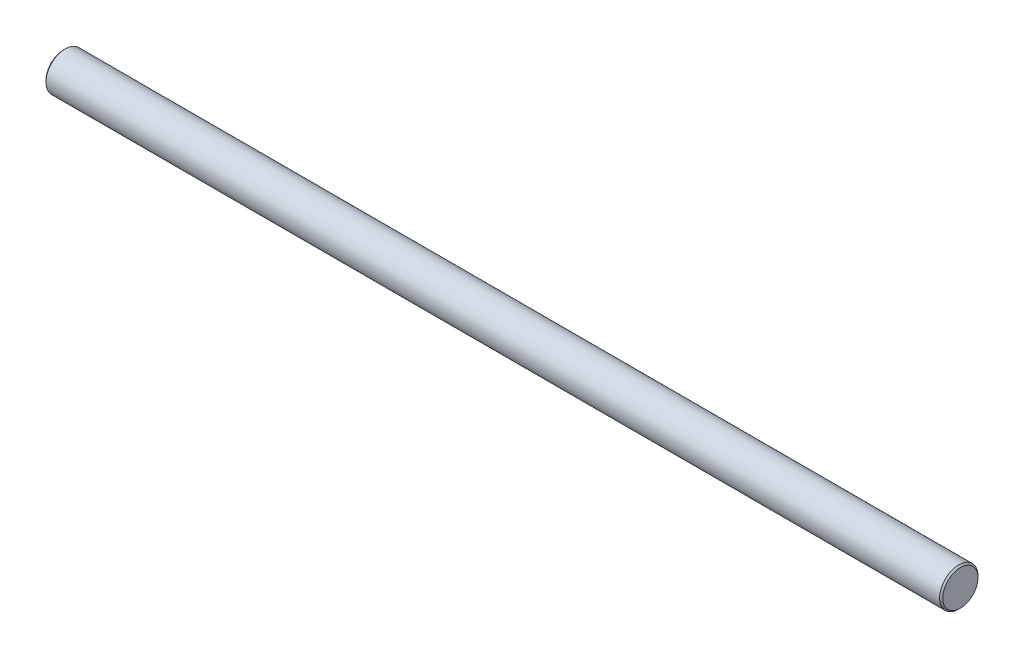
ISO-10303-21;
HEADER;
FILE_DESCRIPTION(('STEP AP214'),'2;1');
FILE_NAME('part.step','',(''),(''),'','','');
FILE_SCHEMA(('AUTOMOTIVE_DESIGN { 1 0 10303 214 1 1 1 1 }'));
ENDSEC;
DATA;
#1=APPLICATION_CONTEXT('core data for automotive mechanical design processes');
#2=APPLICATION_PROTOCOL_DEFINITION('international standard','automotive_design',2000,#1);
#3=PRODUCT_CONTEXT('',#1,'mechanical');
#4=PRODUCT('Part','Part','',(#3));
#5=PRODUCT_RELATED_PRODUCT_CATEGORY('part','',(#4));
#6=PRODUCT_DEFINITION_FORMATION('','',#4);
#7=PRODUCT_DEFINITION_CONTEXT('part definition',#1,'design');
#8=PRODUCT_DEFINITION('design','',#6,#7);
#9=PRODUCT_DEFINITION_SHAPE('','',#8);
#10=(LENGTH_UNIT() NAMED_UNIT(*) SI_UNIT(.MILLI.,.METRE.));
#11=(NAMED_UNIT(*) PLANE_ANGLE_UNIT() SI_UNIT($,.RADIAN.));
#12=(NAMED_UNIT(*) SI_UNIT($,.STERADIAN.) SOLID_ANGLE_UNIT());
#13=UNCERTAINTY_MEASURE_WITH_UNIT(LENGTH_MEASURE(1.E-05),#10,'distance_accuracy_value','');
#14=(GEOMETRIC_REPRESENTATION_CONTEXT(3) GLOBAL_UNCERTAINTY_ASSIGNED_CONTEXT((#13)) GLOBAL_UNIT_ASSIGNED_CONTEXT((#10,
#11,#12)) REPRESENTATION_CONTEXT('',''));
#15=CARTESIAN_POINT('',(0.,0.,0.));
#16=DIRECTION('',(0.,0.,1.));
#17=DIRECTION('',(1.,0.,0.));
#18=AXIS2_PLACEMENT_3D('',#15,#16,#17);
#19=CARTESIAN_POINT('',(140.,0.,0.));
#20=DIRECTION('',(-1.,0.,0.));
#21=DIRECTION('',(0.,0.,1.));
#22=AXIS2_PLACEMENT_3D('',#19,#20,#21);
#23=CYLINDRICAL_SURFACE('',#22,3.);
#24=CARTESIAN_POINT('',(0.25,0.,0.));
#25=DIRECTION('',(1.,0.,0.));
#26=DIRECTION('',(0.,0.,-1.));
#27=AXIS2_PLACEMENT_3D('',#24,#25,#26);
#28=CIRCLE('',#27,3.);
#29=CARTESIAN_POINT('',(0.25,0.,-3.));
#30=VERTEX_POINT('',#29);
#31=EDGE_CURVE('E40',#30,#30,#28,.T.);
#32=ORIENTED_EDGE('',*,*,#31,.T.);
#33=EDGE_LOOP('',(#32));
#34=FACE_BOUND('',#33,.T.);
#35=CARTESIAN_POINT('',(139.75,0.,0.));
#36=DIRECTION('',(1.,0.,0.));
#37=DIRECTION('',(0.,0.,-1.));
#38=AXIS2_PLACEMENT_3D('',#35,#36,#37);
#39=CIRCLE('',#38,3.);
#40=CARTESIAN_POINT('',(139.75,0.,-3.));
#41=VERTEX_POINT('',#40);
#42=EDGE_CURVE('E44',#41,#41,#39,.F.);
#43=ORIENTED_EDGE('',*,*,#42,.T.);
#44=EDGE_LOOP('',(#43));
#45=FACE_BOUND('',#44,.T.);
#46=ADVANCED_FACE('F29',(#34,#45),#23,.T.);
#47=CARTESIAN_POINT('',(140.,0.,0.));
#48=DIRECTION('',(1.,0.,0.));
#49=DIRECTION('',(0.,0.,-1.));
#50=AXIS2_PLACEMENT_3D('',#47,#48,#49);
#51=PLANE('',#50);
#52=CARTESIAN_POINT('',(140.,0.,0.));
#53=DIRECTION('',(1.,0.,0.));
#54=DIRECTION('',(0.,0.,-1.));
#55=AXIS2_PLACEMENT_3D('',#52,#53,#54);
#56=CIRCLE('',#55,2.75000000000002);
#57=CARTESIAN_POINT('',(140.,0.,-2.75000000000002));
#58=VERTEX_POINT('',#57);
#59=EDGE_CURVE('E10',#58,#58,#56,.T.);
#60=ORIENTED_EDGE('',*,*,#59,.T.);
#61=EDGE_LOOP('',(#60));
#62=FACE_BOUND('',#61,.T.);
#63=ADVANCED_FACE('F60',(#62),#51,.T.);
#64=CARTESIAN_POINT('',(0.,0.,0.));
#65=DIRECTION('',(1.,0.,0.));
#66=DIRECTION('',(0.,0.,-1.));
#67=AXIS2_PLACEMENT_3D('',#64,#65,#66);
#68=PLANE('',#67);
#69=CARTESIAN_POINT('',(0.,0.,0.));
#70=DIRECTION('',(1.,0.,0.));
#71=DIRECTION('',(0.,0.,-1.));
#72=AXIS2_PLACEMENT_3D('',#69,#70,#71);
#73=CIRCLE('',#72,2.74999999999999);
#74=CARTESIAN_POINT('',(0.,0.,-2.74999999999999));
#75=VERTEX_POINT('',#74);
#76=EDGE_CURVE('E36',#75,#75,#73,.F.);
#77=ORIENTED_EDGE('',*,*,#76,.T.);
#78=EDGE_LOOP('',(#77));
#79=FACE_BOUND('',#78,.T.);
#80=ADVANCED_FACE('F57',(#79),#68,.F.);
#81=CARTESIAN_POINT('',(0.25,0.,0.));
#82=DIRECTION('',(1.,0.,0.));
#83=DIRECTION('',(0.,0.,-1.));
#84=AXIS2_PLACEMENT_3D('',#81,#82,#83);
#85=CONICAL_SURFACE('',#84,3.,0.785398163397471);
#86=ORIENTED_EDGE('',*,*,#76,.F.);
#87=EDGE_LOOP('',(#86));
#88=FACE_BOUND('',#87,.T.);
#89=ORIENTED_EDGE('',*,*,#31,.F.);
#90=EDGE_LOOP('',(#89));
#91=FACE_BOUND('',#90,.T.);
#92=ADVANCED_FACE('F53',(#88,#91),#85,.T.);
#93=CARTESIAN_POINT('',(140.,0.,0.));
#94=DIRECTION('',(-1.,0.,0.));
#95=DIRECTION('',(0.,0.,1.));
#96=AXIS2_PLACEMENT_3D('',#93,#94,#95);
#97=CONICAL_SURFACE('',#96,2.75000000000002,0.785398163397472);
#98=ORIENTED_EDGE('',*,*,#42,.F.);
#99=EDGE_LOOP('',(#98));
#100=FACE_BOUND('',#99,.T.);
#101=ORIENTED_EDGE('',*,*,#59,.F.);
#102=EDGE_LOOP('',(#101));
#103=FACE_BOUND('',#102,.T.);
#104=ADVANCED_FACE('F31',(#100,#103),#97,.T.);
#105=CLOSED_SHELL('',(#46,#63,#80,#92,#104));
#106=MANIFOLD_SOLID_BREP('B2',#105);
#107=ADVANCED_BREP_SHAPE_REPRESENTATION('',(#18,#106),#14);
#108=SHAPE_DEFINITION_REPRESENTATION(#9,#107);
ENDSEC;
END-ISO-10303-21;
